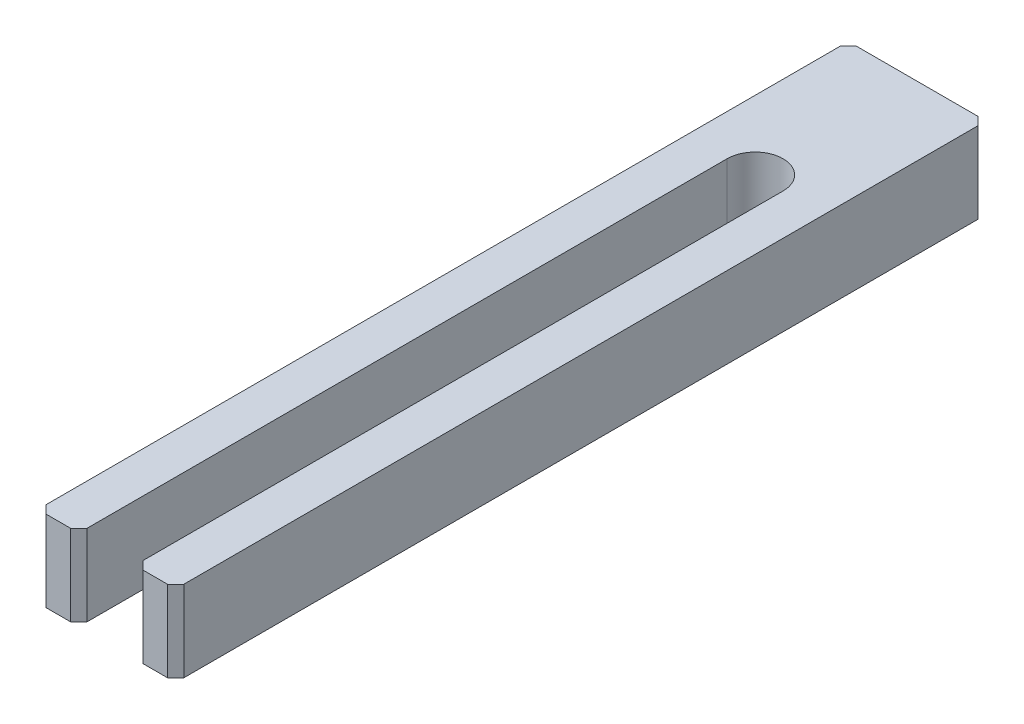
ISO-10303-21;
HEADER;
FILE_DESCRIPTION(('STEP AP214'),'2;1');
FILE_NAME('part.step','',(''),(''),'','','');
FILE_SCHEMA(('AUTOMOTIVE_DESIGN { 1 0 10303 214 1 1 1 1 }'));
ENDSEC;
DATA;
#1=APPLICATION_CONTEXT('core data for automotive mechanical design processes');
#2=APPLICATION_PROTOCOL_DEFINITION('international standard','automotive_design',2000,#1);
#3=PRODUCT_CONTEXT('',#1,'mechanical');
#4=PRODUCT('Part','Part','',(#3));
#5=PRODUCT_RELATED_PRODUCT_CATEGORY('part','',(#4));
#6=PRODUCT_DEFINITION_FORMATION('','',#4);
#7=PRODUCT_DEFINITION_CONTEXT('part definition',#1,'design');
#8=PRODUCT_DEFINITION('design','',#6,#7);
#9=PRODUCT_DEFINITION_SHAPE('','',#8);
#10=(LENGTH_UNIT() NAMED_UNIT(*) SI_UNIT(.MILLI.,.METRE.));
#11=(NAMED_UNIT(*) PLANE_ANGLE_UNIT() SI_UNIT($,.RADIAN.));
#12=(NAMED_UNIT(*) SI_UNIT($,.STERADIAN.) SOLID_ANGLE_UNIT());
#13=UNCERTAINTY_MEASURE_WITH_UNIT(LENGTH_MEASURE(1.E-05),#10,'distance_accuracy_value','');
#14=(GEOMETRIC_REPRESENTATION_CONTEXT(3) GLOBAL_UNCERTAINTY_ASSIGNED_CONTEXT((#13)) GLOBAL_UNIT_ASSIGNED_CONTEXT((#10,
#11,#12)) REPRESENTATION_CONTEXT('',''));
#15=CARTESIAN_POINT('',(0.,0.,0.));
#16=DIRECTION('',(0.,0.,1.));
#17=DIRECTION('',(1.,0.,0.));
#18=AXIS2_PLACEMENT_3D('',#15,#16,#17);
#19=CARTESIAN_POINT('',(-17.,20.,100.));
#20=DIRECTION('',(0.,0.,-1.));
#21=DIRECTION('',(-1.,0.,0.));
#22=AXIS2_PLACEMENT_3D('',#19,#20,#21);
#23=PLANE('',#22);
#24=DIRECTION('',(1.,0.,0.));
#25=VECTOR('',#24,1.);
#26=CARTESIAN_POINT('',(-17.,0.,100.));
#27=LINE('',#26,#25);
#28=CARTESIAN_POINT('',(-15.,0.,100.));
#29=VERTEX_POINT('',#28);
#30=CARTESIAN_POINT('',(-8.89999999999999,0.,100.));
#31=VERTEX_POINT('',#30);
#32=EDGE_CURVE('E186',#29,#31,#27,.T.);
#33=ORIENTED_EDGE('',*,*,#32,.T.);
#34=DIRECTION('',(0.,1.,0.));
#35=VECTOR('',#34,1.);
#36=CARTESIAN_POINT('',(-8.89999999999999,20.,100.));
#37=LINE('',#36,#35);
#38=CARTESIAN_POINT('',(-8.89999999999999,20.,100.));
#39=VERTEX_POINT('',#38);
#40=EDGE_CURVE('E226',#31,#39,#37,.T.);
#41=ORIENTED_EDGE('',*,*,#40,.T.);
#42=DIRECTION('',(1.,0.,0.));
#43=VECTOR('',#42,1.);
#44=CARTESIAN_POINT('',(-17.,20.,100.));
#45=LINE('',#44,#43);
#46=CARTESIAN_POINT('',(-15.,20.,100.));
#47=VERTEX_POINT('',#46);
#48=EDGE_CURVE('E175',#47,#39,#45,.T.);
#49=ORIENTED_EDGE('',*,*,#48,.F.);
#50=DIRECTION('',(0.,-1.,0.));
#51=VECTOR('',#50,1.);
#52=CARTESIAN_POINT('',(-15.,20.,100.));
#53=LINE('',#52,#51);
#54=EDGE_CURVE('E223',#47,#29,#53,.T.);
#55=ORIENTED_EDGE('',*,*,#54,.T.);
#56=EDGE_LOOP('',(#33,#41,#49,#55));
#57=FACE_BOUND('',#56,.T.);
#58=ADVANCED_FACE('F31',(#57),#23,.F.);
#59=CARTESIAN_POINT('',(-17.,20.,-100.));
#60=DIRECTION('',(1.,0.,0.));
#61=DIRECTION('',(0.,0.,-1.));
#62=AXIS2_PLACEMENT_3D('',#59,#60,#61);
#63=PLANE('',#62);
#64=DIRECTION('',(0.,0.,1.));
#65=VECTOR('',#64,1.);
#66=CARTESIAN_POINT('',(-17.,0.,-100.));
#67=LINE('',#66,#65);
#68=CARTESIAN_POINT('',(-17.,0.,-98.));
#69=VERTEX_POINT('',#68);
#70=CARTESIAN_POINT('',(-17.,0.,98.));
#71=VERTEX_POINT('',#70);
#72=EDGE_CURVE('E162',#69,#71,#67,.T.);
#73=ORIENTED_EDGE('',*,*,#72,.T.);
#74=DIRECTION('',(0.,1.,0.));
#75=VECTOR('',#74,1.);
#76=CARTESIAN_POINT('',(-17.,20.,98.));
#77=LINE('',#76,#75);
#78=CARTESIAN_POINT('',(-17.,20.,98.));
#79=VERTEX_POINT('',#78);
#80=EDGE_CURVE('E233',#71,#79,#77,.T.);
#81=ORIENTED_EDGE('',*,*,#80,.T.);
#82=DIRECTION('',(0.,0.,1.));
#83=VECTOR('',#82,1.);
#84=CARTESIAN_POINT('',(-17.,20.,-100.));
#85=LINE('',#84,#83);
#86=CARTESIAN_POINT('',(-17.,20.,-98.));
#87=VERTEX_POINT('',#86);
#88=EDGE_CURVE('E171',#87,#79,#85,.T.);
#89=ORIENTED_EDGE('',*,*,#88,.F.);
#90=DIRECTION('',(0.,-1.,0.));
#91=VECTOR('',#90,1.);
#92=CARTESIAN_POINT('',(-17.,20.,-98.));
#93=LINE('',#92,#91);
#94=EDGE_CURVE('E230',#87,#69,#93,.T.);
#95=ORIENTED_EDGE('',*,*,#94,.T.);
#96=EDGE_LOOP('',(#73,#81,#89,#95));
#97=FACE_BOUND('',#96,.T.);
#98=ADVANCED_FACE('F249',(#97),#63,.F.);
#99=CARTESIAN_POINT('',(8.90000000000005,0.,100.));
#100=VERTEX_POINT('',#99);
#101=CARTESIAN_POINT('',(15.,0.,100.));
#102=VERTEX_POINT('',#101);
#103=EDGE_CURVE('E166',#100,#102,#27,.T.);
#104=ORIENTED_EDGE('',*,*,#103,.T.);
#105=DIRECTION('',(0.,1.,0.));
#106=VECTOR('',#105,1.);
#107=CARTESIAN_POINT('',(15.,20.,100.));
#108=LINE('',#107,#106);
#109=CARTESIAN_POINT('',(15.,20.,100.));
#110=VERTEX_POINT('',#109);
#111=EDGE_CURVE('E209',#102,#110,#108,.T.);
#112=ORIENTED_EDGE('',*,*,#111,.T.);
#113=CARTESIAN_POINT('',(8.90000000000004,20.,100.));
#114=VERTEX_POINT('',#113);
#115=EDGE_CURVE('E173',#114,#110,#45,.T.);
#116=ORIENTED_EDGE('',*,*,#115,.F.);
#117=DIRECTION('',(0.,-1.,0.));
#118=VECTOR('',#117,1.);
#119=CARTESIAN_POINT('',(8.90000000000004,20.,100.));
#120=LINE('',#119,#118);
#121=EDGE_CURVE('E207',#114,#100,#120,.T.);
#122=ORIENTED_EDGE('',*,*,#121,.T.);
#123=EDGE_LOOP('',(#104,#112,#116,#122));
#124=FACE_BOUND('',#123,.T.);
#125=ADVANCED_FACE('F281',(#124),#23,.F.);
#126=CARTESIAN_POINT('',(17.,20.,-100.));
#127=DIRECTION('',(-1.,0.,0.));
#128=DIRECTION('',(0.,0.,1.));
#129=AXIS2_PLACEMENT_3D('',#126,#127,#128);
#130=PLANE('',#129);
#131=DIRECTION('',(0.,0.,-1.));
#132=VECTOR('',#131,1.);
#133=CARTESIAN_POINT('',(17.,20.,-100.));
#134=LINE('',#133,#132);
#135=CARTESIAN_POINT('',(17.,20.,98.));
#136=VERTEX_POINT('',#135);
#137=CARTESIAN_POINT('',(17.,20.,-98.));
#138=VERTEX_POINT('',#137);
#139=EDGE_CURVE('E177',#136,#138,#134,.T.);
#140=ORIENTED_EDGE('',*,*,#139,.F.);
#141=DIRECTION('',(0.,-1.,0.));
#142=VECTOR('',#141,1.);
#143=CARTESIAN_POINT('',(17.,20.,98.));
#144=LINE('',#143,#142);
#145=CARTESIAN_POINT('',(17.,0.,98.));
#146=VERTEX_POINT('',#145);
#147=EDGE_CURVE('E193',#136,#146,#144,.T.);
#148=ORIENTED_EDGE('',*,*,#147,.T.);
#149=DIRECTION('',(0.,0.,-1.));
#150=VECTOR('',#149,1.);
#151=CARTESIAN_POINT('',(17.,0.,-100.));
#152=LINE('',#151,#150);
#153=CARTESIAN_POINT('',(17.,0.,-98.));
#154=VERTEX_POINT('',#153);
#155=EDGE_CURVE('E187',#146,#154,#152,.T.);
#156=ORIENTED_EDGE('',*,*,#155,.T.);
#157=DIRECTION('',(0.,1.,0.));
#158=VECTOR('',#157,1.);
#159=CARTESIAN_POINT('',(17.,20.,-98.));
#160=LINE('',#159,#158);
#161=EDGE_CURVE('E182',#154,#138,#160,.T.);
#162=ORIENTED_EDGE('',*,*,#161,.T.);
#163=EDGE_LOOP('',(#140,#148,#156,#162));
#164=FACE_BOUND('',#163,.T.);
#165=ADVANCED_FACE('F288',(#164),#130,.F.);
#166=CARTESIAN_POINT('',(-17.,20.,-100.));
#167=DIRECTION('',(0.,0.,1.));
#168=DIRECTION('',(1.,0.,0.));
#169=AXIS2_PLACEMENT_3D('',#166,#167,#168);
#170=PLANE('',#169);
#171=DIRECTION('',(-1.,0.,0.));
#172=VECTOR('',#171,1.);
#173=CARTESIAN_POINT('',(-17.,20.,-100.));
#174=LINE('',#173,#172);
#175=CARTESIAN_POINT('',(15.,20.,-100.));
#176=VERTEX_POINT('',#175);
#177=CARTESIAN_POINT('',(-15.,20.,-100.));
#178=VERTEX_POINT('',#177);
#179=EDGE_CURVE('E180',#176,#178,#174,.T.);
#180=ORIENTED_EDGE('',*,*,#179,.F.);
#181=DIRECTION('',(0.,-1.,0.));
#182=VECTOR('',#181,1.);
#183=CARTESIAN_POINT('',(15.,20.,-100.));
#184=LINE('',#183,#182);
#185=CARTESIAN_POINT('',(15.,0.,-100.));
#186=VERTEX_POINT('',#185);
#187=EDGE_CURVE('E11',#176,#186,#184,.T.);
#188=ORIENTED_EDGE('',*,*,#187,.T.);
#189=DIRECTION('',(-1.,0.,0.));
#190=VECTOR('',#189,1.);
#191=CARTESIAN_POINT('',(-17.,0.,-100.));
#192=LINE('',#191,#190);
#193=CARTESIAN_POINT('',(-15.,0.,-100.));
#194=VERTEX_POINT('',#193);
#195=EDGE_CURVE('E174',#186,#194,#192,.T.);
#196=ORIENTED_EDGE('',*,*,#195,.T.);
#197=DIRECTION('',(0.,1.,0.));
#198=VECTOR('',#197,1.);
#199=CARTESIAN_POINT('',(-15.,20.,-100.));
#200=LINE('',#199,#198);
#201=EDGE_CURVE('E39',#194,#178,#200,.T.);
#202=ORIENTED_EDGE('',*,*,#201,.T.);
#203=EDGE_LOOP('',(#180,#188,#196,#202));
#204=FACE_BOUND('',#203,.T.);
#205=ADVANCED_FACE('F237',(#204),#170,.F.);
#206=CARTESIAN_POINT('',(-17.,20.,100.));
#207=DIRECTION('',(0.,1.,0.));
#208=DIRECTION('',(0.,0.,1.));
#209=AXIS2_PLACEMENT_3D('',#206,#207,#208);
#210=PLANE('',#209);
#211=ORIENTED_EDGE('',*,*,#115,.T.);
#212=DIRECTION('',(-0.707106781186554,0.,0.707106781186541));
#213=VECTOR('',#212,1.);
#214=CARTESIAN_POINT('',(-1.0000000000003,20.,116.));
#215=LINE('',#214,#213);
#216=EDGE_CURVE('E219',#110,#136,#215,.F.);
#217=ORIENTED_EDGE('',*,*,#216,.T.);
#218=ORIENTED_EDGE('',*,*,#139,.T.);
#219=DIRECTION('',(0.707106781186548,0.,0.707106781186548));
#220=VECTOR('',#219,1.);
#221=CARTESIAN_POINT('',(99.,20.,-16.));
#222=LINE('',#221,#220);
#223=EDGE_CURVE('E213',#138,#176,#222,.F.);
#224=ORIENTED_EDGE('',*,*,#223,.T.);
#225=ORIENTED_EDGE('',*,*,#179,.T.);
#226=DIRECTION('',(0.707106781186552,0.,-0.707106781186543));
#227=VECTOR('',#226,1.);
#228=CARTESIAN_POINT('',(-116.,20.,0.999999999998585));
#229=LINE('',#228,#227);
#230=EDGE_CURVE('E211',#178,#87,#229,.F.);
#231=ORIENTED_EDGE('',*,*,#230,.T.);
#232=ORIENTED_EDGE('',*,*,#88,.T.);
#233=DIRECTION('',(-0.707106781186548,0.,-0.707106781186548));
#234=VECTOR('',#233,1.);
#235=CARTESIAN_POINT('',(-16.,20.,99.));
#236=LINE('',#235,#234);
#237=EDGE_CURVE('E54',#79,#47,#236,.F.);
#238=ORIENTED_EDGE('',*,*,#237,.T.);
#239=ORIENTED_EDGE('',*,*,#48,.T.);
#240=DIRECTION('',(-0.707106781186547,0.,0.707106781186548));
#241=VECTOR('',#240,1.);
#242=CARTESIAN_POINT('',(-12.95,20.,104.05));
#243=LINE('',#242,#241);
#244=CARTESIAN_POINT('',(-6.89999999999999,20.,98.));
#245=VERTEX_POINT('',#244);
#246=EDGE_CURVE('E46',#39,#245,#243,.F.);
#247=ORIENTED_EDGE('',*,*,#246,.T.);
#248=DIRECTION('',(0.,0.,1.));
#249=VECTOR('',#248,1.);
#250=CARTESIAN_POINT('',(-6.89999999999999,20.,100.));
#251=LINE('',#250,#249);
#252=CARTESIAN_POINT('',(-6.90000000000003,20.,-60.));
#253=VERTEX_POINT('',#252);
#254=EDGE_CURVE('E259',#253,#245,#251,.T.);
#255=ORIENTED_EDGE('',*,*,#254,.F.);
#256=CARTESIAN_POINT('',(0.,20.,-60.));
#257=DIRECTION('',(0.,1.,0.));
#258=DIRECTION('',(0.,0.,1.));
#259=AXIS2_PLACEMENT_3D('',#256,#257,#258);
#260=CIRCLE('',#259,6.9);
#261=CARTESIAN_POINT('',(6.9,20.,-60.));
#262=VERTEX_POINT('',#261);
#263=EDGE_CURVE('E163',#262,#253,#260,.T.);
#264=ORIENTED_EDGE('',*,*,#263,.F.);
#265=DIRECTION('',(0.,0.,-1.));
#266=VECTOR('',#265,1.);
#267=CARTESIAN_POINT('',(6.90000000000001,20.,100.));
#268=LINE('',#267,#266);
#269=CARTESIAN_POINT('',(6.90000000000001,20.,98.));
#270=VERTEX_POINT('',#269);
#271=EDGE_CURVE('E154',#270,#262,#268,.T.);
#272=ORIENTED_EDGE('',*,*,#271,.F.);
#273=DIRECTION('',(-0.707106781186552,0.,-0.707106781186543));
#274=VECTOR('',#273,1.);
#275=CARTESIAN_POINT('',(-4.05000000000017,20.,87.05));
#276=LINE('',#275,#274);
#277=EDGE_CURVE('E217',#270,#114,#276,.F.);
#278=ORIENTED_EDGE('',*,*,#277,.T.);
#279=EDGE_LOOP('',(#211,#217,#218,#224,#225,#231,#232,#238,#239,#247,#255,#264,#272,#278));
#280=FACE_BOUND('',#279,.T.);
#281=ADVANCED_FACE('F243',(#280),#210,.T.);
#282=CARTESIAN_POINT('',(-17.,0.,100.));
#283=DIRECTION('',(0.,1.,0.));
#284=DIRECTION('',(0.,0.,1.));
#285=AXIS2_PLACEMENT_3D('',#282,#283,#284);
#286=PLANE('',#285);
#287=ORIENTED_EDGE('',*,*,#155,.F.);
#288=DIRECTION('',(0.707106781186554,0.,-0.707106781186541));
#289=VECTOR('',#288,1.);
#290=CARTESIAN_POINT('',(17.,0.,98.));
#291=LINE('',#290,#289);
#292=EDGE_CURVE('E205',#146,#102,#291,.F.);
#293=ORIENTED_EDGE('',*,*,#292,.T.);
#294=ORIENTED_EDGE('',*,*,#103,.F.);
#295=DIRECTION('',(0.707106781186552,0.,0.707106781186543));
#296=VECTOR('',#295,1.);
#297=CARTESIAN_POINT('',(6.90000000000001,0.,98.));
#298=LINE('',#297,#296);
#299=CARTESIAN_POINT('',(6.90000000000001,0.,98.));
#300=VERTEX_POINT('',#299);
#301=EDGE_CURVE('E144',#100,#300,#298,.F.);
#302=ORIENTED_EDGE('',*,*,#301,.T.);
#303=DIRECTION('',(0.,0.,-1.));
#304=VECTOR('',#303,1.);
#305=CARTESIAN_POINT('',(6.90000000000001,0.,100.));
#306=LINE('',#305,#304);
#307=CARTESIAN_POINT('',(6.90000000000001,0.,-60.));
#308=VERTEX_POINT('',#307);
#309=EDGE_CURVE('E135',#300,#308,#306,.T.);
#310=ORIENTED_EDGE('',*,*,#309,.T.);
#311=CARTESIAN_POINT('',(0.,0.,-60.));
#312=DIRECTION('',(0.,1.,0.));
#313=DIRECTION('',(0.,0.,1.));
#314=AXIS2_PLACEMENT_3D('',#311,#312,#313);
#315=CIRCLE('',#314,6.9);
#316=CARTESIAN_POINT('',(-6.9,0.,-60.));
#317=VERTEX_POINT('',#316);
#318=EDGE_CURVE('E141',#308,#317,#315,.T.);
#319=ORIENTED_EDGE('',*,*,#318,.T.);
#320=DIRECTION('',(0.,0.,1.));
#321=VECTOR('',#320,1.);
#322=CARTESIAN_POINT('',(-6.89999999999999,0.,100.));
#323=LINE('',#322,#321);
#324=CARTESIAN_POINT('',(-6.89999999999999,0.,98.));
#325=VERTEX_POINT('',#324);
#326=EDGE_CURVE('E149',#317,#325,#323,.T.);
#327=ORIENTED_EDGE('',*,*,#326,.T.);
#328=DIRECTION('',(0.707106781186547,0.,-0.707106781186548));
#329=VECTOR('',#328,1.);
#330=CARTESIAN_POINT('',(-8.89999999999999,0.,100.));
#331=LINE('',#330,#329);
#332=EDGE_CURVE('E202',#325,#31,#331,.F.);
#333=ORIENTED_EDGE('',*,*,#332,.T.);
#334=ORIENTED_EDGE('',*,*,#32,.F.);
#335=DIRECTION('',(0.707106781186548,0.,0.707106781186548));
#336=VECTOR('',#335,1.);
#337=CARTESIAN_POINT('',(-15.,0.,100.));
#338=LINE('',#337,#336);
#339=EDGE_CURVE('E200',#29,#71,#338,.F.);
#340=ORIENTED_EDGE('',*,*,#339,.T.);
#341=ORIENTED_EDGE('',*,*,#72,.F.);
#342=DIRECTION('',(-0.707106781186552,0.,0.707106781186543));
#343=VECTOR('',#342,1.);
#344=CARTESIAN_POINT('',(-17.,0.,-98.));
#345=LINE('',#344,#343);
#346=EDGE_CURVE('E196',#69,#194,#345,.F.);
#347=ORIENTED_EDGE('',*,*,#346,.T.);
#348=ORIENTED_EDGE('',*,*,#195,.F.);
#349=DIRECTION('',(-0.707106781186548,0.,-0.707106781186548));
#350=VECTOR('',#349,1.);
#351=CARTESIAN_POINT('',(15.,0.,-100.));
#352=LINE('',#351,#350);
#353=EDGE_CURVE('E198',#186,#154,#352,.F.);
#354=ORIENTED_EDGE('',*,*,#353,.T.);
#355=EDGE_LOOP('',(#287,#293,#294,#302,#310,#319,#327,#333,#334,#340,#341,#347,#348,#354));
#356=FACE_BOUND('',#355,.T.);
#357=ADVANCED_FACE('F138',(#356),#286,.F.);
#358=CARTESIAN_POINT('',(0.,0.,-60.));
#359=DIRECTION('',(0.,1.,0.));
#360=DIRECTION('',(0.,0.,1.));
#361=AXIS2_PLACEMENT_3D('',#358,#359,#360);
#362=CYLINDRICAL_SURFACE('',#361,6.9);
#363=ORIENTED_EDGE('',*,*,#263,.T.);
#364=DIRECTION('',(0.,1.,0.));
#365=VECTOR('',#364,1.);
#366=CARTESIAN_POINT('',(-6.90000000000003,0.,-60.));
#367=LINE('',#366,#365);
#368=EDGE_CURVE('E158',#317,#253,#367,.T.);
#369=ORIENTED_EDGE('',*,*,#368,.F.);
#370=ORIENTED_EDGE('',*,*,#318,.F.);
#371=DIRECTION('',(0.,1.,0.));
#372=VECTOR('',#371,1.);
#373=CARTESIAN_POINT('',(6.90000000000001,0.,-60.));
#374=LINE('',#373,#372);
#375=EDGE_CURVE('E148',#308,#262,#374,.T.);
#376=ORIENTED_EDGE('',*,*,#375,.T.);
#377=EDGE_LOOP('',(#363,#369,#370,#376));
#378=FACE_BOUND('',#377,.T.);
#379=ADVANCED_FACE('F161',(#378),#362,.F.);
#380=CARTESIAN_POINT('',(6.90000000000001,0.,100.));
#381=DIRECTION('',(1.,0.,0.));
#382=DIRECTION('',(0.,0.,-1.));
#383=AXIS2_PLACEMENT_3D('',#380,#381,#382);
#384=PLANE('',#383);
#385=ORIENTED_EDGE('',*,*,#309,.F.);
#386=DIRECTION('',(0.,1.,0.));
#387=VECTOR('',#386,1.);
#388=CARTESIAN_POINT('',(6.90000000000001,0.,98.));
#389=LINE('',#388,#387);
#390=EDGE_CURVE('E221',#300,#270,#389,.T.);
#391=ORIENTED_EDGE('',*,*,#390,.T.);
#392=ORIENTED_EDGE('',*,*,#271,.T.);
#393=ORIENTED_EDGE('',*,*,#375,.F.);
#394=EDGE_LOOP('',(#385,#391,#392,#393));
#395=FACE_BOUND('',#394,.T.);
#396=ADVANCED_FACE('F152',(#395),#384,.F.);
#397=CARTESIAN_POINT('',(-6.89999999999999,0.,100.));
#398=DIRECTION('',(-1.,0.,0.));
#399=DIRECTION('',(0.,0.,1.));
#400=AXIS2_PLACEMENT_3D('',#397,#398,#399);
#401=PLANE('',#400);
#402=ORIENTED_EDGE('',*,*,#254,.T.);
#403=DIRECTION('',(0.,-1.,0.));
#404=VECTOR('',#403,1.);
#405=CARTESIAN_POINT('',(-6.89999999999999,0.,98.));
#406=LINE('',#405,#404);
#407=EDGE_CURVE('E228',#245,#325,#406,.T.);
#408=ORIENTED_EDGE('',*,*,#407,.T.);
#409=ORIENTED_EDGE('',*,*,#326,.F.);
#410=ORIENTED_EDGE('',*,*,#368,.T.);
#411=EDGE_LOOP('',(#402,#408,#409,#410));
#412=FACE_BOUND('',#411,.T.);
#413=ADVANCED_FACE('F261',(#412),#401,.F.);
#414=CARTESIAN_POINT('',(17.,20.,98.));
#415=DIRECTION('',(-0.707106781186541,0.,-0.707106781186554));
#416=DIRECTION('',(-0.707106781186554,0.,0.707106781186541));
#417=AXIS2_PLACEMENT_3D('',#414,#415,#416);
#418=PLANE('',#417);
#419=ORIENTED_EDGE('',*,*,#216,.F.);
#420=ORIENTED_EDGE('',*,*,#111,.F.);
#421=ORIENTED_EDGE('',*,*,#292,.F.);
#422=ORIENTED_EDGE('',*,*,#147,.F.);
#423=EDGE_LOOP('',(#419,#420,#421,#422));
#424=FACE_BOUND('',#423,.T.);
#425=ADVANCED_FACE('F276',(#424),#418,.F.);
#426=CARTESIAN_POINT('',(6.90000000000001,0.,98.));
#427=DIRECTION('',(0.707106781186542,0.,-0.707106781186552));
#428=DIRECTION('',(-0.707106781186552,0.,-0.707106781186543));
#429=AXIS2_PLACEMENT_3D('',#426,#427,#428);
#430=PLANE('',#429);
#431=ORIENTED_EDGE('',*,*,#301,.F.);
#432=ORIENTED_EDGE('',*,*,#121,.F.);
#433=ORIENTED_EDGE('',*,*,#277,.F.);
#434=ORIENTED_EDGE('',*,*,#390,.F.);
#435=EDGE_LOOP('',(#431,#432,#433,#434));
#436=FACE_BOUND('',#435,.T.);
#437=ADVANCED_FACE('F268',(#436),#430,.F.);
#438=CARTESIAN_POINT('',(-8.89999999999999,20.,100.));
#439=DIRECTION('',(-0.707106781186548,0.,-0.707106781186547));
#440=DIRECTION('',(-0.707106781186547,0.,0.707106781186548));
#441=AXIS2_PLACEMENT_3D('',#438,#439,#440);
#442=PLANE('',#441);
#443=ORIENTED_EDGE('',*,*,#332,.F.);
#444=ORIENTED_EDGE('',*,*,#407,.F.);
#445=ORIENTED_EDGE('',*,*,#246,.F.);
#446=ORIENTED_EDGE('',*,*,#40,.F.);
#447=EDGE_LOOP('',(#443,#444,#445,#446));
#448=FACE_BOUND('',#447,.T.);
#449=ADVANCED_FACE('F264',(#448),#442,.F.);
#450=CARTESIAN_POINT('',(-15.,20.,100.));
#451=DIRECTION('',(0.707106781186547,0.,-0.707106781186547));
#452=DIRECTION('',(-0.707106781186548,0.,-0.707106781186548));
#453=AXIS2_PLACEMENT_3D('',#450,#451,#452);
#454=PLANE('',#453);
#455=ORIENTED_EDGE('',*,*,#237,.F.);
#456=ORIENTED_EDGE('',*,*,#80,.F.);
#457=ORIENTED_EDGE('',*,*,#339,.F.);
#458=ORIENTED_EDGE('',*,*,#54,.F.);
#459=EDGE_LOOP('',(#455,#456,#457,#458));
#460=FACE_BOUND('',#459,.T.);
#461=ADVANCED_FACE('F255',(#460),#454,.F.);
#462=CARTESIAN_POINT('',(15.,20.,-100.));
#463=DIRECTION('',(-0.707106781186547,0.,0.707106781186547));
#464=DIRECTION('',(0.707106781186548,0.,0.707106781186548));
#465=AXIS2_PLACEMENT_3D('',#462,#463,#464);
#466=PLANE('',#465);
#467=ORIENTED_EDGE('',*,*,#223,.F.);
#468=ORIENTED_EDGE('',*,*,#161,.F.);
#469=ORIENTED_EDGE('',*,*,#353,.F.);
#470=ORIENTED_EDGE('',*,*,#187,.F.);
#471=EDGE_LOOP('',(#467,#468,#469,#470));
#472=FACE_BOUND('',#471,.T.);
#473=ADVANCED_FACE('F274',(#472),#466,.F.);
#474=CARTESIAN_POINT('',(-17.,20.,-98.));
#475=DIRECTION('',(0.707106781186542,0.,0.707106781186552));
#476=DIRECTION('',(0.707106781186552,0.,-0.707106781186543));
#477=AXIS2_PLACEMENT_3D('',#474,#475,#476);
#478=PLANE('',#477);
#479=ORIENTED_EDGE('',*,*,#230,.F.);
#480=ORIENTED_EDGE('',*,*,#201,.F.);
#481=ORIENTED_EDGE('',*,*,#346,.F.);
#482=ORIENTED_EDGE('',*,*,#94,.F.);
#483=EDGE_LOOP('',(#479,#480,#481,#482));
#484=FACE_BOUND('',#483,.T.);
#485=ADVANCED_FACE('F33',(#484),#478,.F.);
#486=CLOSED_SHELL('',(#58,#98,#125,#165,#205,#281,#357,#379,#396,#413,#425,#437,#449,#461,#473,#485));
#487=MANIFOLD_SOLID_BREP('B2',#486);
#488=ADVANCED_BREP_SHAPE_REPRESENTATION('',(#18,#487),#14);
#489=SHAPE_DEFINITION_REPRESENTATION(#9,#488);
ENDSEC;
END-ISO-10303-21;
